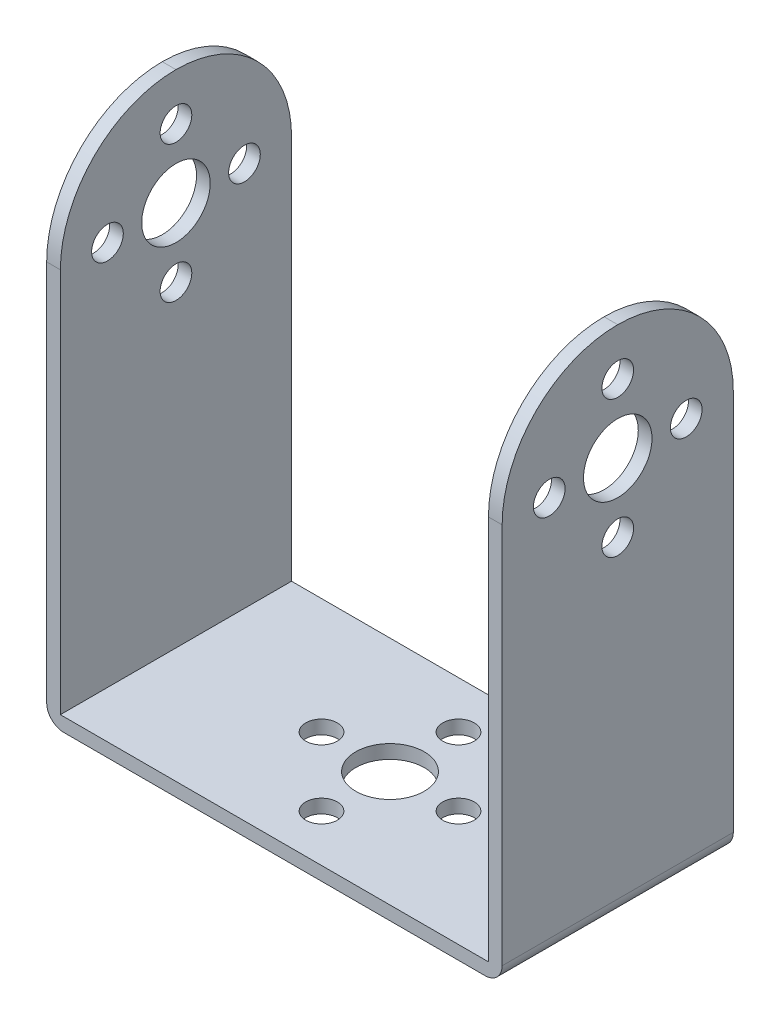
ISO-10303-21;
HEADER;
FILE_DESCRIPTION(('STEP AP214'),'2;1');
FILE_NAME('part.step','',(''),(''),'','','');
FILE_SCHEMA(('AUTOMOTIVE_DESIGN { 1 0 10303 214 1 1 1 1 }'));
ENDSEC;
DATA;
#1=APPLICATION_CONTEXT('core data for automotive mechanical design processes');
#2=APPLICATION_PROTOCOL_DEFINITION('international standard','automotive_design',2000,#1);
#3=PRODUCT_CONTEXT('',#1,'mechanical');
#4=PRODUCT('Part','Part','',(#3));
#5=PRODUCT_RELATED_PRODUCT_CATEGORY('part','',(#4));
#6=PRODUCT_DEFINITION_FORMATION('','',#4);
#7=PRODUCT_DEFINITION_CONTEXT('part definition',#1,'design');
#8=PRODUCT_DEFINITION('design','',#6,#7);
#9=PRODUCT_DEFINITION_SHAPE('','',#8);
#10=(LENGTH_UNIT() NAMED_UNIT(*) SI_UNIT(.MILLI.,.METRE.));
#11=(NAMED_UNIT(*) PLANE_ANGLE_UNIT() SI_UNIT($,.RADIAN.));
#12=(NAMED_UNIT(*) SI_UNIT($,.STERADIAN.) SOLID_ANGLE_UNIT());
#13=UNCERTAINTY_MEASURE_WITH_UNIT(LENGTH_MEASURE(1.E-05),#10,'distance_accuracy_value','');
#14=(GEOMETRIC_REPRESENTATION_CONTEXT(3) GLOBAL_UNCERTAINTY_ASSIGNED_CONTEXT((#13)) GLOBAL_UNIT_ASSIGNED_CONTEXT((#10,
#11,#12)) REPRESENTATION_CONTEXT('',''));
#15=CARTESIAN_POINT('',(0.,0.,0.));
#16=DIRECTION('',(0.,0.,1.));
#17=DIRECTION('',(1.,0.,0.));
#18=AXIS2_PLACEMENT_3D('',#15,#16,#17);
#19=CARTESIAN_POINT('',(0.,60.1,-27.));
#20=DIRECTION('',(-1.,0.,0.));
#21=DIRECTION('',(0.,-1.,0.));
#22=AXIS2_PLACEMENT_3D('',#19,#20,#21);
#23=PLANE('',#22);
#24=CARTESIAN_POINT('',(0.,54.6,-13.5));
#25=DIRECTION('',(1.,0.,0.));
#26=DIRECTION('',(0.,0.,-1.));
#27=AXIS2_PLACEMENT_3D('',#24,#25,#26);
#28=CIRCLE('',#27,1.85);
#29=CARTESIAN_POINT('',(0.,54.6,-15.35));
#30=VERTEX_POINT('',#29);
#31=EDGE_CURVE('E309',#30,#30,#28,.T.);
#32=ORIENTED_EDGE('',*,*,#31,.T.);
#33=EDGE_LOOP('',(#32));
#34=FACE_BOUND('',#33,.T.);
#35=CARTESIAN_POINT('',(0.,38.6,-13.5));
#36=DIRECTION('',(1.,0.,0.));
#37=DIRECTION('',(0.,0.,-1.));
#38=AXIS2_PLACEMENT_3D('',#35,#36,#37);
#39=CIRCLE('',#38,1.85);
#40=CARTESIAN_POINT('',(0.,38.6,-15.35));
#41=VERTEX_POINT('',#40);
#42=EDGE_CURVE('E297',#41,#41,#39,.T.);
#43=ORIENTED_EDGE('',*,*,#42,.T.);
#44=EDGE_LOOP('',(#43));
#45=FACE_BOUND('',#44,.T.);
#46=CARTESIAN_POINT('',(0.,46.6,-5.5));
#47=DIRECTION('',(1.,0.,0.));
#48=DIRECTION('',(0.,0.,-1.));
#49=AXIS2_PLACEMENT_3D('',#46,#47,#48);
#50=CIRCLE('',#49,1.85);
#51=CARTESIAN_POINT('',(0.,46.6,-7.35));
#52=VERTEX_POINT('',#51);
#53=EDGE_CURVE('E285',#52,#52,#50,.T.);
#54=ORIENTED_EDGE('',*,*,#53,.T.);
#55=EDGE_LOOP('',(#54));
#56=FACE_BOUND('',#55,.T.);
#57=CARTESIAN_POINT('',(0.,46.6,-21.5));
#58=DIRECTION('',(1.,0.,0.));
#59=DIRECTION('',(0.,0.,-1.));
#60=AXIS2_PLACEMENT_3D('',#57,#58,#59);
#61=CIRCLE('',#60,1.85);
#62=CARTESIAN_POINT('',(0.,46.6,-23.35));
#63=VERTEX_POINT('',#62);
#64=EDGE_CURVE('E273',#63,#63,#61,.T.);
#65=ORIENTED_EDGE('',*,*,#64,.T.);
#66=EDGE_LOOP('',(#65));
#67=FACE_BOUND('',#66,.T.);
#68=CARTESIAN_POINT('',(0.,46.6,-13.5));
#69=DIRECTION('',(1.,0.,0.));
#70=DIRECTION('',(0.,0.,-1.));
#71=AXIS2_PLACEMENT_3D('',#68,#69,#70);
#72=CIRCLE('',#71,4.);
#73=CARTESIAN_POINT('',(0.,46.6,-17.5));
#74=VERTEX_POINT('',#73);
#75=EDGE_CURVE('E261',#74,#74,#72,.T.);
#76=ORIENTED_EDGE('',*,*,#75,.T.);
#77=EDGE_LOOP('',(#76));
#78=FACE_BOUND('',#77,.T.);
#79=DIRECTION('',(0.,-1.,0.));
#80=VECTOR('',#79,1.);
#81=CARTESIAN_POINT('',(0.,60.1,-27.));
#82=LINE('',#81,#80);
#83=CARTESIAN_POINT('',(0.,46.6,-27.));
#84=VERTEX_POINT('',#83);
#85=CARTESIAN_POINT('',(0.,2.,-27.));
#86=VERTEX_POINT('',#85);
#87=EDGE_CURVE('E167',#84,#86,#82,.T.);
#88=ORIENTED_EDGE('',*,*,#87,.T.);
#89=DIRECTION('',(0.,0.,1.));
#90=VECTOR('',#89,1.);
#91=CARTESIAN_POINT('',(0.,2.,-27.));
#92=LINE('',#91,#90);
#93=CARTESIAN_POINT('',(0.,2.,0.));
#94=VERTEX_POINT('',#93);
#95=EDGE_CURVE('E211',#86,#94,#92,.T.);
#96=ORIENTED_EDGE('',*,*,#95,.T.);
#97=DIRECTION('',(0.,-1.,0.));
#98=VECTOR('',#97,1.);
#99=CARTESIAN_POINT('',(0.,60.1,0.));
#100=LINE('',#99,#98);
#101=CARTESIAN_POINT('',(0.,46.6,0.));
#102=VERTEX_POINT('',#101);
#103=EDGE_CURVE('E154',#102,#94,#100,.T.);
#104=ORIENTED_EDGE('',*,*,#103,.F.);
#105=CARTESIAN_POINT('',(0.,46.6,-13.5));
#106=DIRECTION('',(-1.,0.,0.));
#107=DIRECTION('',(0.,-1.,0.));
#108=AXIS2_PLACEMENT_3D('',#105,#106,#107);
#109=CIRCLE('',#108,13.5);
#110=CARTESIAN_POINT('',(0.,60.1,-13.5));
#111=VERTEX_POINT('',#110);
#112=EDGE_CURVE('E197',#102,#111,#109,.T.);
#113=ORIENTED_EDGE('',*,*,#112,.T.);
#114=CARTESIAN_POINT('',(0.,46.6,-13.5));
#115=DIRECTION('',(-1.,0.,0.));
#116=DIRECTION('',(0.,-1.,0.));
#117=AXIS2_PLACEMENT_3D('',#114,#115,#116);
#118=CIRCLE('',#117,13.5);
#119=EDGE_CURVE('E188',#111,#84,#118,.T.);
#120=ORIENTED_EDGE('',*,*,#119,.T.);
#121=EDGE_LOOP('',(#88,#96,#104,#113,#120));
#122=FACE_BOUND('',#121,.T.);
#123=ADVANCED_FACE('F37',(#34,#45,#56,#67,#78,#122),#23,.T.);
#124=CARTESIAN_POINT('',(1.6,1.59999999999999,-27.));
#125=DIRECTION('',(1.,0.,0.));
#126=DIRECTION('',(0.,0.,-1.));
#127=AXIS2_PLACEMENT_3D('',#124,#125,#126);
#128=PLANE('',#127);
#129=CARTESIAN_POINT('',(1.6,54.6,-13.5));
#130=DIRECTION('',(1.,0.,0.));
#131=DIRECTION('',(0.,0.,-1.));
#132=AXIS2_PLACEMENT_3D('',#129,#130,#131);
#133=CIRCLE('',#132,1.85);
#134=CARTESIAN_POINT('',(1.6,54.6,-15.35));
#135=VERTEX_POINT('',#134);
#136=EDGE_CURVE('E301',#135,#135,#133,.T.);
#137=ORIENTED_EDGE('',*,*,#136,.F.);
#138=EDGE_LOOP('',(#137));
#139=FACE_BOUND('',#138,.T.);
#140=CARTESIAN_POINT('',(1.6,38.6,-13.5));
#141=DIRECTION('',(1.,0.,0.));
#142=DIRECTION('',(0.,0.,-1.));
#143=AXIS2_PLACEMENT_3D('',#140,#141,#142);
#144=CIRCLE('',#143,1.85);
#145=CARTESIAN_POINT('',(1.6,38.6,-15.35));
#146=VERTEX_POINT('',#145);
#147=EDGE_CURVE('E289',#146,#146,#144,.T.);
#148=ORIENTED_EDGE('',*,*,#147,.F.);
#149=EDGE_LOOP('',(#148));
#150=FACE_BOUND('',#149,.T.);
#151=CARTESIAN_POINT('',(1.6,46.6,-5.5));
#152=DIRECTION('',(1.,0.,0.));
#153=DIRECTION('',(0.,0.,-1.));
#154=AXIS2_PLACEMENT_3D('',#151,#152,#153);
#155=CIRCLE('',#154,1.85);
#156=CARTESIAN_POINT('',(1.6,46.6,-7.35));
#157=VERTEX_POINT('',#156);
#158=EDGE_CURVE('E277',#157,#157,#155,.T.);
#159=ORIENTED_EDGE('',*,*,#158,.F.);
#160=EDGE_LOOP('',(#159));
#161=FACE_BOUND('',#160,.T.);
#162=CARTESIAN_POINT('',(1.6,46.6,-21.5));
#163=DIRECTION('',(1.,0.,0.));
#164=DIRECTION('',(0.,0.,-1.));
#165=AXIS2_PLACEMENT_3D('',#162,#163,#164);
#166=CIRCLE('',#165,1.85);
#167=CARTESIAN_POINT('',(1.6,46.6,-23.35));
#168=VERTEX_POINT('',#167);
#169=EDGE_CURVE('E265',#168,#168,#166,.T.);
#170=ORIENTED_EDGE('',*,*,#169,.F.);
#171=EDGE_LOOP('',(#170));
#172=FACE_BOUND('',#171,.T.);
#173=CARTESIAN_POINT('',(1.6,46.6,-13.5));
#174=DIRECTION('',(1.,0.,0.));
#175=DIRECTION('',(0.,0.,-1.));
#176=AXIS2_PLACEMENT_3D('',#173,#174,#175);
#177=CIRCLE('',#176,4.);
#178=CARTESIAN_POINT('',(1.6,46.6,-17.5));
#179=VERTEX_POINT('',#178);
#180=EDGE_CURVE('E157',#179,#179,#177,.T.);
#181=ORIENTED_EDGE('',*,*,#180,.F.);
#182=EDGE_LOOP('',(#181));
#183=FACE_BOUND('',#182,.T.);
#184=CARTESIAN_POINT('',(1.6,46.6,-13.5));
#185=DIRECTION('',(1.,0.,0.));
#186=DIRECTION('',(0.,0.,-1.));
#187=AXIS2_PLACEMENT_3D('',#184,#185,#186);
#188=CIRCLE('',#187,13.5);
#189=CARTESIAN_POINT('',(1.6,46.6,-27.));
#190=VERTEX_POINT('',#189);
#191=CARTESIAN_POINT('',(1.6,60.1,-13.5));
#192=VERTEX_POINT('',#191);
#193=EDGE_CURVE('E192',#190,#192,#188,.T.);
#194=ORIENTED_EDGE('',*,*,#193,.T.);
#195=CARTESIAN_POINT('',(1.6,46.6,-13.5));
#196=DIRECTION('',(1.,0.,0.));
#197=DIRECTION('',(0.,0.,-1.));
#198=AXIS2_PLACEMENT_3D('',#195,#196,#197);
#199=CIRCLE('',#198,13.5);
#200=CARTESIAN_POINT('',(1.6,46.6,0.));
#201=VERTEX_POINT('',#200);
#202=EDGE_CURVE('E199',#192,#201,#199,.T.);
#203=ORIENTED_EDGE('',*,*,#202,.T.);
#204=DIRECTION('',(0.,1.,0.));
#205=VECTOR('',#204,1.);
#206=CARTESIAN_POINT('',(1.6,1.59999999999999,0.));
#207=LINE('',#206,#205);
#208=CARTESIAN_POINT('',(1.6,1.59999999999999,0.));
#209=VERTEX_POINT('',#208);
#210=EDGE_CURVE('E164',#209,#201,#207,.T.);
#211=ORIENTED_EDGE('',*,*,#210,.F.);
#212=DIRECTION('',(0.,0.,1.));
#213=VECTOR('',#212,1.);
#214=CARTESIAN_POINT('',(1.6,1.59999999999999,-27.));
#215=LINE('',#214,#213);
#216=CARTESIAN_POINT('',(1.6,1.59999999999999,-27.));
#217=VERTEX_POINT('',#216);
#218=EDGE_CURVE('E144',#217,#209,#215,.T.);
#219=ORIENTED_EDGE('',*,*,#218,.F.);
#220=DIRECTION('',(0.,1.,0.));
#221=VECTOR('',#220,1.);
#222=CARTESIAN_POINT('',(1.6,1.59999999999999,-27.));
#223=LINE('',#222,#221);
#224=EDGE_CURVE('E145',#217,#190,#223,.T.);
#225=ORIENTED_EDGE('',*,*,#224,.T.);
#226=EDGE_LOOP('',(#194,#203,#211,#219,#225));
#227=FACE_BOUND('',#226,.T.);
#228=ADVANCED_FACE('F234',(#139,#150,#161,#172,#183,#227),#128,.T.);
#229=CARTESIAN_POINT('',(51.6,1.6,-27.));
#230=DIRECTION('',(0.,1.,0.));
#231=DIRECTION('',(-1.,0.,0.));
#232=AXIS2_PLACEMENT_3D('',#229,#230,#231);
#233=PLANE('',#232);
#234=CARTESIAN_POINT('',(26.6,1.59999999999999,-5.5));
#235=DIRECTION('',(0.,1.,0.));
#236=DIRECTION('',(-1.,0.,0.));
#237=AXIS2_PLACEMENT_3D('',#234,#235,#236);
#238=CIRCLE('',#237,1.85);
#239=CARTESIAN_POINT('',(24.75,1.59999999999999,-5.5));
#240=VERTEX_POINT('',#239);
#241=EDGE_CURVE('E339',#240,#240,#238,.T.);
#242=ORIENTED_EDGE('',*,*,#241,.F.);
#243=EDGE_LOOP('',(#242));
#244=FACE_BOUND('',#243,.T.);
#245=CARTESIAN_POINT('',(26.6,1.59999999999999,-21.5));
#246=DIRECTION('',(0.,1.,0.));
#247=DIRECTION('',(-1.,0.,0.));
#248=AXIS2_PLACEMENT_3D('',#245,#246,#247);
#249=CIRCLE('',#248,1.85);
#250=CARTESIAN_POINT('',(24.75,1.59999999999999,-21.5));
#251=VERTEX_POINT('',#250);
#252=EDGE_CURVE('E333',#251,#251,#249,.T.);
#253=ORIENTED_EDGE('',*,*,#252,.F.);
#254=EDGE_LOOP('',(#253));
#255=FACE_BOUND('',#254,.T.);
#256=CARTESIAN_POINT('',(18.6,1.59999999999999,-13.5));
#257=DIRECTION('',(0.,1.,0.));
#258=DIRECTION('',(-1.,0.,0.));
#259=AXIS2_PLACEMENT_3D('',#256,#257,#258);
#260=CIRCLE('',#259,1.85);
#261=CARTESIAN_POINT('',(16.75,1.59999999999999,-13.5));
#262=VERTEX_POINT('',#261);
#263=EDGE_CURVE('E327',#262,#262,#260,.T.);
#264=ORIENTED_EDGE('',*,*,#263,.F.);
#265=EDGE_LOOP('',(#264));
#266=FACE_BOUND('',#265,.T.);
#267=CARTESIAN_POINT('',(34.6,1.6,-13.5));
#268=DIRECTION('',(0.,1.,0.));
#269=DIRECTION('',(-1.,0.,0.));
#270=AXIS2_PLACEMENT_3D('',#267,#268,#269);
#271=CIRCLE('',#270,1.84999999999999);
#272=CARTESIAN_POINT('',(32.75,1.6,-13.5));
#273=VERTEX_POINT('',#272);
#274=EDGE_CURVE('E321',#273,#273,#271,.T.);
#275=ORIENTED_EDGE('',*,*,#274,.F.);
#276=EDGE_LOOP('',(#275));
#277=FACE_BOUND('',#276,.T.);
#278=CARTESIAN_POINT('',(26.6,1.59999999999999,-13.5));
#279=DIRECTION('',(0.,1.,0.));
#280=DIRECTION('',(-1.,0.,0.));
#281=AXIS2_PLACEMENT_3D('',#278,#279,#280);
#282=CIRCLE('',#281,4.);
#283=CARTESIAN_POINT('',(22.6,1.59999999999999,-13.5));
#284=VERTEX_POINT('',#283);
#285=EDGE_CURVE('E313',#284,#284,#282,.T.);
#286=ORIENTED_EDGE('',*,*,#285,.F.);
#287=EDGE_LOOP('',(#286));
#288=FACE_BOUND('',#287,.T.);
#289=DIRECTION('',(-1.,0.,0.));
#290=VECTOR('',#289,1.);
#291=CARTESIAN_POINT('',(51.6,1.6,0.));
#292=LINE('',#291,#290);
#293=CARTESIAN_POINT('',(51.6,1.6,0.));
#294=VERTEX_POINT('',#293);
#295=EDGE_CURVE('E143',#294,#209,#292,.T.);
#296=ORIENTED_EDGE('',*,*,#295,.F.);
#297=DIRECTION('',(0.,0.,1.));
#298=VECTOR('',#297,1.);
#299=CARTESIAN_POINT('',(51.6,1.6,-27.));
#300=LINE('',#299,#298);
#301=CARTESIAN_POINT('',(51.6,1.6,-27.));
#302=VERTEX_POINT('',#301);
#303=EDGE_CURVE('E129',#302,#294,#300,.T.);
#304=ORIENTED_EDGE('',*,*,#303,.F.);
#305=DIRECTION('',(-1.,0.,0.));
#306=VECTOR('',#305,1.);
#307=CARTESIAN_POINT('',(51.6,1.6,-27.));
#308=LINE('',#307,#306);
#309=EDGE_CURVE('E136',#302,#217,#308,.T.);
#310=ORIENTED_EDGE('',*,*,#309,.T.);
#311=ORIENTED_EDGE('',*,*,#218,.T.);
#312=EDGE_LOOP('',(#296,#304,#310,#311));
#313=FACE_BOUND('',#312,.T.);
#314=ADVANCED_FACE('F141',(#244,#255,#266,#277,#288,#313),#233,.T.);
#315=CARTESIAN_POINT('',(51.6,60.1,-27.));
#316=DIRECTION('',(-1.,0.,0.));
#317=DIRECTION('',(0.,-1.,0.));
#318=AXIS2_PLACEMENT_3D('',#315,#316,#317);
#319=PLANE('',#318);
#320=CARTESIAN_POINT('',(51.6,54.6,-13.5));
#321=DIRECTION('',(-1.,0.,0.));
#322=DIRECTION('',(0.,-1.,0.));
#323=AXIS2_PLACEMENT_3D('',#320,#321,#322);
#324=CIRCLE('',#323,1.85);
#325=CARTESIAN_POINT('',(51.6,52.75,-13.5));
#326=VERTEX_POINT('',#325);
#327=EDGE_CURVE('E306',#326,#326,#324,.T.);
#328=ORIENTED_EDGE('',*,*,#327,.F.);
#329=EDGE_LOOP('',(#328));
#330=FACE_BOUND('',#329,.T.);
#331=CARTESIAN_POINT('',(51.6,38.6,-13.5));
#332=DIRECTION('',(-1.,0.,0.));
#333=DIRECTION('',(0.,-1.,0.));
#334=AXIS2_PLACEMENT_3D('',#331,#332,#333);
#335=CIRCLE('',#334,1.85);
#336=CARTESIAN_POINT('',(51.6,36.75,-13.5));
#337=VERTEX_POINT('',#336);
#338=EDGE_CURVE('E294',#337,#337,#335,.T.);
#339=ORIENTED_EDGE('',*,*,#338,.F.);
#340=EDGE_LOOP('',(#339));
#341=FACE_BOUND('',#340,.T.);
#342=CARTESIAN_POINT('',(51.6,46.6,-5.5));
#343=DIRECTION('',(-1.,0.,0.));
#344=DIRECTION('',(0.,-1.,0.));
#345=AXIS2_PLACEMENT_3D('',#342,#343,#344);
#346=CIRCLE('',#345,1.85);
#347=CARTESIAN_POINT('',(51.6,44.75,-5.5));
#348=VERTEX_POINT('',#347);
#349=EDGE_CURVE('E282',#348,#348,#346,.T.);
#350=ORIENTED_EDGE('',*,*,#349,.F.);
#351=EDGE_LOOP('',(#350));
#352=FACE_BOUND('',#351,.T.);
#353=CARTESIAN_POINT('',(51.6,46.6,-21.5));
#354=DIRECTION('',(-1.,0.,0.));
#355=DIRECTION('',(0.,-1.,0.));
#356=AXIS2_PLACEMENT_3D('',#353,#354,#355);
#357=CIRCLE('',#356,1.85);
#358=CARTESIAN_POINT('',(51.6,44.75,-21.5));
#359=VERTEX_POINT('',#358);
#360=EDGE_CURVE('E270',#359,#359,#357,.T.);
#361=ORIENTED_EDGE('',*,*,#360,.F.);
#362=EDGE_LOOP('',(#361));
#363=FACE_BOUND('',#362,.T.);
#364=CARTESIAN_POINT('',(51.6,46.6,-13.5));
#365=DIRECTION('',(-1.,0.,0.));
#366=DIRECTION('',(0.,-1.,0.));
#367=AXIS2_PLACEMENT_3D('',#364,#365,#366);
#368=CIRCLE('',#367,4.);
#369=CARTESIAN_POINT('',(51.6,42.6,-13.5));
#370=VERTEX_POINT('',#369);
#371=EDGE_CURVE('E258',#370,#370,#368,.T.);
#372=ORIENTED_EDGE('',*,*,#371,.F.);
#373=EDGE_LOOP('',(#372));
#374=FACE_BOUND('',#373,.T.);
#375=CARTESIAN_POINT('',(51.6,46.6,-13.5));
#376=DIRECTION('',(-1.,0.,0.));
#377=DIRECTION('',(0.,-1.,0.));
#378=AXIS2_PLACEMENT_3D('',#375,#376,#377);
#379=CIRCLE('',#378,13.5);
#380=CARTESIAN_POINT('',(51.6,46.6,0.));
#381=VERTEX_POINT('',#380);
#382=CARTESIAN_POINT('',(51.6,60.1,-13.5));
#383=VERTEX_POINT('',#382);
#384=EDGE_CURVE('E172',#381,#383,#379,.T.);
#385=ORIENTED_EDGE('',*,*,#384,.T.);
#386=CARTESIAN_POINT('',(51.6,46.6,-13.5));
#387=DIRECTION('',(-1.,0.,0.));
#388=DIRECTION('',(0.,-1.,0.));
#389=AXIS2_PLACEMENT_3D('',#386,#387,#388);
#390=CIRCLE('',#389,13.5);
#391=CARTESIAN_POINT('',(51.6,46.6,-27.));
#392=VERTEX_POINT('',#391);
#393=EDGE_CURVE('E131',#383,#392,#390,.T.);
#394=ORIENTED_EDGE('',*,*,#393,.T.);
#395=DIRECTION('',(0.,-1.,0.));
#396=VECTOR('',#395,1.);
#397=CARTESIAN_POINT('',(51.6,60.1,-27.));
#398=LINE('',#397,#396);
#399=EDGE_CURVE('E124',#392,#302,#398,.T.);
#400=ORIENTED_EDGE('',*,*,#399,.T.);
#401=ORIENTED_EDGE('',*,*,#303,.T.);
#402=DIRECTION('',(0.,-1.,0.));
#403=VECTOR('',#402,1.);
#404=CARTESIAN_POINT('',(51.6,60.1,0.));
#405=LINE('',#404,#403);
#406=EDGE_CURVE('E161',#381,#294,#405,.T.);
#407=ORIENTED_EDGE('',*,*,#406,.F.);
#408=EDGE_LOOP('',(#385,#394,#400,#401,#407));
#409=FACE_BOUND('',#408,.T.);
#410=ADVANCED_FACE('F127',(#330,#341,#352,#363,#374,#409),#319,.T.);
#411=CARTESIAN_POINT('',(53.2,0.,-27.));
#412=DIRECTION('',(1.,0.,0.));
#413=DIRECTION('',(0.,0.,-1.));
#414=AXIS2_PLACEMENT_3D('',#411,#412,#413);
#415=PLANE('',#414);
#416=CARTESIAN_POINT('',(53.2,54.6,-13.5));
#417=DIRECTION('',(1.,0.,0.));
#418=DIRECTION('',(0.,0.,-1.));
#419=AXIS2_PLACEMENT_3D('',#416,#417,#418);
#420=CIRCLE('',#419,1.85);
#421=CARTESIAN_POINT('',(53.2,54.6,-15.35));
#422=VERTEX_POINT('',#421);
#423=EDGE_CURVE('E310',#422,#422,#420,.T.);
#424=ORIENTED_EDGE('',*,*,#423,.F.);
#425=EDGE_LOOP('',(#424));
#426=FACE_BOUND('',#425,.T.);
#427=CARTESIAN_POINT('',(53.2,38.6,-13.5));
#428=DIRECTION('',(1.,0.,0.));
#429=DIRECTION('',(0.,0.,-1.));
#430=AXIS2_PLACEMENT_3D('',#427,#428,#429);
#431=CIRCLE('',#430,1.85);
#432=CARTESIAN_POINT('',(53.2,38.6,-15.35));
#433=VERTEX_POINT('',#432);
#434=EDGE_CURVE('E298',#433,#433,#431,.T.);
#435=ORIENTED_EDGE('',*,*,#434,.F.);
#436=EDGE_LOOP('',(#435));
#437=FACE_BOUND('',#436,.T.);
#438=CARTESIAN_POINT('',(53.2,46.6,-5.5));
#439=DIRECTION('',(1.,0.,0.));
#440=DIRECTION('',(0.,0.,-1.));
#441=AXIS2_PLACEMENT_3D('',#438,#439,#440);
#442=CIRCLE('',#441,1.85);
#443=CARTESIAN_POINT('',(53.2,46.6,-7.35));
#444=VERTEX_POINT('',#443);
#445=EDGE_CURVE('E286',#444,#444,#442,.T.);
#446=ORIENTED_EDGE('',*,*,#445,.F.);
#447=EDGE_LOOP('',(#446));
#448=FACE_BOUND('',#447,.T.);
#449=CARTESIAN_POINT('',(53.2,46.6,-21.5));
#450=DIRECTION('',(1.,0.,0.));
#451=DIRECTION('',(0.,0.,-1.));
#452=AXIS2_PLACEMENT_3D('',#449,#450,#451);
#453=CIRCLE('',#452,1.85);
#454=CARTESIAN_POINT('',(53.2,46.6,-23.35));
#455=VERTEX_POINT('',#454);
#456=EDGE_CURVE('E274',#455,#455,#453,.T.);
#457=ORIENTED_EDGE('',*,*,#456,.F.);
#458=EDGE_LOOP('',(#457));
#459=FACE_BOUND('',#458,.T.);
#460=CARTESIAN_POINT('',(53.2,46.6,-13.5));
#461=DIRECTION('',(1.,0.,0.));
#462=DIRECTION('',(0.,0.,-1.));
#463=AXIS2_PLACEMENT_3D('',#460,#461,#462);
#464=CIRCLE('',#463,4.);
#465=CARTESIAN_POINT('',(53.2,46.6,-17.5));
#466=VERTEX_POINT('',#465);
#467=EDGE_CURVE('E262',#466,#466,#464,.T.);
#468=ORIENTED_EDGE('',*,*,#467,.F.);
#469=EDGE_LOOP('',(#468));
#470=FACE_BOUND('',#469,.T.);
#471=DIRECTION('',(0.,1.,0.));
#472=VECTOR('',#471,1.);
#473=CARTESIAN_POINT('',(53.2,0.,0.));
#474=LINE('',#473,#472);
#475=CARTESIAN_POINT('',(53.2,2.,0.));
#476=VERTEX_POINT('',#475);
#477=CARTESIAN_POINT('',(53.2,46.6,0.));
#478=VERTEX_POINT('',#477);
#479=EDGE_CURVE('E159',#476,#478,#474,.T.);
#480=ORIENTED_EDGE('',*,*,#479,.F.);
#481=DIRECTION('',(0.,0.,1.));
#482=VECTOR('',#481,1.);
#483=CARTESIAN_POINT('',(53.2,2.,-27.));
#484=LINE('',#483,#482);
#485=CARTESIAN_POINT('',(53.2,2.,-27.));
#486=VERTEX_POINT('',#485);
#487=EDGE_CURVE('E206',#476,#486,#484,.F.);
#488=ORIENTED_EDGE('',*,*,#487,.T.);
#489=DIRECTION('',(0.,1.,0.));
#490=VECTOR('',#489,1.);
#491=CARTESIAN_POINT('',(53.2,0.,-27.));
#492=LINE('',#491,#490);
#493=CARTESIAN_POINT('',(53.2,46.6,-27.));
#494=VERTEX_POINT('',#493);
#495=EDGE_CURVE('E137',#486,#494,#492,.T.);
#496=ORIENTED_EDGE('',*,*,#495,.T.);
#497=CARTESIAN_POINT('',(53.2,46.6,-13.5));
#498=DIRECTION('',(1.,0.,0.));
#499=DIRECTION('',(0.,0.,-1.));
#500=AXIS2_PLACEMENT_3D('',#497,#498,#499);
#501=CIRCLE('',#500,13.5);
#502=CARTESIAN_POINT('',(53.2,60.1,-13.5));
#503=VERTEX_POINT('',#502);
#504=EDGE_CURVE('E183',#494,#503,#501,.T.);
#505=ORIENTED_EDGE('',*,*,#504,.T.);
#506=CARTESIAN_POINT('',(53.2,46.6,-13.5));
#507=DIRECTION('',(1.,0.,0.));
#508=DIRECTION('',(0.,0.,-1.));
#509=AXIS2_PLACEMENT_3D('',#506,#507,#508);
#510=CIRCLE('',#509,13.5);
#511=EDGE_CURVE('E177',#503,#478,#510,.T.);
#512=ORIENTED_EDGE('',*,*,#511,.T.);
#513=EDGE_LOOP('',(#480,#488,#496,#505,#512));
#514=FACE_BOUND('',#513,.T.);
#515=ADVANCED_FACE('F350',(#426,#437,#448,#459,#470,#514),#415,.T.);
#516=CARTESIAN_POINT('',(0.,0.,-27.));
#517=DIRECTION('',(0.,-1.,0.));
#518=DIRECTION('',(0.,0.,-1.));
#519=AXIS2_PLACEMENT_3D('',#516,#517,#518);
#520=PLANE('',#519);
#521=CARTESIAN_POINT('',(26.6,0.,-5.5));
#522=DIRECTION('',(0.,-1.,0.));
#523=DIRECTION('',(0.,0.,-1.));
#524=AXIS2_PLACEMENT_3D('',#521,#522,#523);
#525=CIRCLE('',#524,1.85);
#526=CARTESIAN_POINT('',(26.6,0.,-7.35));
#527=VERTEX_POINT('',#526);
#528=EDGE_CURVE('E342',#527,#527,#525,.T.);
#529=ORIENTED_EDGE('',*,*,#528,.F.);
#530=EDGE_LOOP('',(#529));
#531=FACE_BOUND('',#530,.T.);
#532=CARTESIAN_POINT('',(26.6,0.,-21.5));
#533=DIRECTION('',(0.,-1.,0.));
#534=DIRECTION('',(0.,0.,-1.));
#535=AXIS2_PLACEMENT_3D('',#532,#533,#534);
#536=CIRCLE('',#535,1.85);
#537=CARTESIAN_POINT('',(26.6,0.,-23.35));
#538=VERTEX_POINT('',#537);
#539=EDGE_CURVE('E336',#538,#538,#536,.T.);
#540=ORIENTED_EDGE('',*,*,#539,.F.);
#541=EDGE_LOOP('',(#540));
#542=FACE_BOUND('',#541,.T.);
#543=CARTESIAN_POINT('',(18.6,0.,-13.5));
#544=DIRECTION('',(0.,-1.,0.));
#545=DIRECTION('',(0.,0.,-1.));
#546=AXIS2_PLACEMENT_3D('',#543,#544,#545);
#547=CIRCLE('',#546,1.85);
#548=CARTESIAN_POINT('',(18.6,0.,-15.35));
#549=VERTEX_POINT('',#548);
#550=EDGE_CURVE('E330',#549,#549,#547,.T.);
#551=ORIENTED_EDGE('',*,*,#550,.F.);
#552=EDGE_LOOP('',(#551));
#553=FACE_BOUND('',#552,.T.);
#554=CARTESIAN_POINT('',(34.6,0.,-13.5));
#555=DIRECTION('',(0.,-1.,0.));
#556=DIRECTION('',(0.,0.,-1.));
#557=AXIS2_PLACEMENT_3D('',#554,#555,#556);
#558=CIRCLE('',#557,1.84999999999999);
#559=CARTESIAN_POINT('',(34.6,0.,-15.35));
#560=VERTEX_POINT('',#559);
#561=EDGE_CURVE('E324',#560,#560,#558,.T.);
#562=ORIENTED_EDGE('',*,*,#561,.F.);
#563=EDGE_LOOP('',(#562));
#564=FACE_BOUND('',#563,.T.);
#565=CARTESIAN_POINT('',(26.6,0.,-13.5));
#566=DIRECTION('',(0.,-1.,0.));
#567=DIRECTION('',(0.,0.,-1.));
#568=AXIS2_PLACEMENT_3D('',#565,#566,#567);
#569=CIRCLE('',#568,4.);
#570=CARTESIAN_POINT('',(26.6,0.,-17.5));
#571=VERTEX_POINT('',#570);
#572=EDGE_CURVE('E318',#571,#571,#569,.T.);
#573=ORIENTED_EDGE('',*,*,#572,.F.);
#574=EDGE_LOOP('',(#573));
#575=FACE_BOUND('',#574,.T.);
#576=DIRECTION('',(1.,0.,0.));
#577=VECTOR('',#576,1.);
#578=CARTESIAN_POINT('',(0.,0.,0.));
#579=LINE('',#578,#577);
#580=CARTESIAN_POINT('',(2.,0.,0.));
#581=VERTEX_POINT('',#580);
#582=CARTESIAN_POINT('',(51.2,0.,0.));
#583=VERTEX_POINT('',#582);
#584=EDGE_CURVE('E156',#581,#583,#579,.T.);
#585=ORIENTED_EDGE('',*,*,#584,.F.);
#586=DIRECTION('',(0.,0.,1.));
#587=VECTOR('',#586,1.);
#588=CARTESIAN_POINT('',(2.,0.,-27.));
#589=LINE('',#588,#587);
#590=CARTESIAN_POINT('',(2.,0.,-27.));
#591=VERTEX_POINT('',#590);
#592=EDGE_CURVE('E45',#581,#591,#589,.F.);
#593=ORIENTED_EDGE('',*,*,#592,.T.);
#594=DIRECTION('',(1.,0.,0.));
#595=VECTOR('',#594,1.);
#596=CARTESIAN_POINT('',(0.,0.,-27.));
#597=LINE('',#596,#595);
#598=CARTESIAN_POINT('',(51.2,0.,-27.));
#599=VERTEX_POINT('',#598);
#600=EDGE_CURVE('E247',#591,#599,#597,.T.);
#601=ORIENTED_EDGE('',*,*,#600,.T.);
#602=DIRECTION('',(0.,0.,1.));
#603=VECTOR('',#602,1.);
#604=CARTESIAN_POINT('',(51.2,0.,-27.));
#605=LINE('',#604,#603);
#606=EDGE_CURVE('E201',#599,#583,#605,.T.);
#607=ORIENTED_EDGE('',*,*,#606,.T.);
#608=EDGE_LOOP('',(#585,#593,#601,#607));
#609=FACE_BOUND('',#608,.T.);
#610=ADVANCED_FACE('F252',(#531,#542,#553,#564,#575,#609),#520,.T.);
#611=CARTESIAN_POINT('',(0.,60.1,-27.));
#612=DIRECTION('',(0.,0.,-1.));
#613=DIRECTION('',(-1.,0.,0.));
#614=AXIS2_PLACEMENT_3D('',#611,#612,#613);
#615=PLANE('',#614);
#616=ORIENTED_EDGE('',*,*,#600,.F.);
#617=CARTESIAN_POINT('',(2.,2.,-27.));
#618=DIRECTION('',(0.,0.,-1.));
#619=DIRECTION('',(-1.,0.,0.));
#620=AXIS2_PLACEMENT_3D('',#617,#618,#619);
#621=CIRCLE('',#620,2.);
#622=EDGE_CURVE('E11',#591,#86,#621,.T.);
#623=ORIENTED_EDGE('',*,*,#622,.T.);
#624=ORIENTED_EDGE('',*,*,#87,.F.);
#625=DIRECTION('',(-1.,0.,0.));
#626=VECTOR('',#625,1.);
#627=CARTESIAN_POINT('',(0.,46.6,-27.));
#628=LINE('',#627,#626);
#629=EDGE_CURVE('E190',#84,#190,#628,.F.);
#630=ORIENTED_EDGE('',*,*,#629,.T.);
#631=ORIENTED_EDGE('',*,*,#224,.F.);
#632=ORIENTED_EDGE('',*,*,#309,.F.);
#633=ORIENTED_EDGE('',*,*,#399,.F.);
#634=DIRECTION('',(-1.,0.,0.));
#635=VECTOR('',#634,1.);
#636=CARTESIAN_POINT('',(0.,46.6,-27.));
#637=LINE('',#636,#635);
#638=EDGE_CURVE('E181',#392,#494,#637,.F.);
#639=ORIENTED_EDGE('',*,*,#638,.T.);
#640=ORIENTED_EDGE('',*,*,#495,.F.);
#641=CARTESIAN_POINT('',(51.2,2.,-27.));
#642=DIRECTION('',(0.,0.,-1.));
#643=DIRECTION('',(-1.,0.,0.));
#644=AXIS2_PLACEMENT_3D('',#641,#642,#643);
#645=CIRCLE('',#644,2.);
#646=EDGE_CURVE('E208',#486,#599,#645,.T.);
#647=ORIENTED_EDGE('',*,*,#646,.T.);
#648=EDGE_LOOP('',(#616,#623,#624,#630,#631,#632,#633,#639,#640,#647));
#649=FACE_BOUND('',#648,.T.);
#650=ADVANCED_FACE('F148',(#649),#615,.T.);
#651=CARTESIAN_POINT('',(0.,60.1,0.));
#652=DIRECTION('',(0.,0.,-1.));
#653=DIRECTION('',(-1.,0.,0.));
#654=AXIS2_PLACEMENT_3D('',#651,#652,#653);
#655=PLANE('',#654);
#656=ORIENTED_EDGE('',*,*,#103,.T.);
#657=CARTESIAN_POINT('',(2.,2.,0.));
#658=DIRECTION('',(0.,0.,-1.));
#659=DIRECTION('',(-1.,0.,0.));
#660=AXIS2_PLACEMENT_3D('',#657,#658,#659);
#661=CIRCLE('',#660,2.);
#662=EDGE_CURVE('E59',#94,#581,#661,.F.);
#663=ORIENTED_EDGE('',*,*,#662,.T.);
#664=ORIENTED_EDGE('',*,*,#584,.T.);
#665=CARTESIAN_POINT('',(51.2,2.,0.));
#666=DIRECTION('',(0.,0.,-1.));
#667=DIRECTION('',(-1.,0.,0.));
#668=AXIS2_PLACEMENT_3D('',#665,#666,#667);
#669=CIRCLE('',#668,2.);
#670=EDGE_CURVE('E204',#583,#476,#669,.F.);
#671=ORIENTED_EDGE('',*,*,#670,.T.);
#672=ORIENTED_EDGE('',*,*,#479,.T.);
#673=DIRECTION('',(-1.,0.,0.));
#674=VECTOR('',#673,1.);
#675=CARTESIAN_POINT('',(51.6,46.6,0.));
#676=LINE('',#675,#674);
#677=EDGE_CURVE('E168',#478,#381,#676,.T.);
#678=ORIENTED_EDGE('',*,*,#677,.T.);
#679=ORIENTED_EDGE('',*,*,#406,.T.);
#680=ORIENTED_EDGE('',*,*,#295,.T.);
#681=ORIENTED_EDGE('',*,*,#210,.T.);
#682=DIRECTION('',(-1.,0.,0.));
#683=VECTOR('',#682,1.);
#684=CARTESIAN_POINT('',(0.,46.6,0.));
#685=LINE('',#684,#683);
#686=EDGE_CURVE('E194',#201,#102,#685,.T.);
#687=ORIENTED_EDGE('',*,*,#686,.T.);
#688=EDGE_LOOP('',(#656,#663,#664,#671,#672,#678,#679,#680,#681,#687));
#689=FACE_BOUND('',#688,.T.);
#690=ADVANCED_FACE('F221',(#689),#655,.F.);
#691=CARTESIAN_POINT('',(0.,46.6,-13.5));
#692=DIRECTION('',(1.,0.,0.));
#693=DIRECTION('',(0.,0.,-1.));
#694=AXIS2_PLACEMENT_3D('',#691,#692,#693);
#695=CYLINDRICAL_SURFACE('',#694,13.5);
#696=ORIENTED_EDGE('',*,*,#511,.F.);
#697=DIRECTION('',(-1.,0.,0.));
#698=VECTOR('',#697,1.);
#699=CARTESIAN_POINT('',(53.2,60.1,-13.5));
#700=LINE('',#699,#698);
#701=EDGE_CURVE('E174',#383,#503,#700,.F.);
#702=ORIENTED_EDGE('',*,*,#701,.F.);
#703=ORIENTED_EDGE('',*,*,#384,.F.);
#704=ORIENTED_EDGE('',*,*,#677,.F.);
#705=EDGE_LOOP('',(#696,#702,#703,#704));
#706=FACE_BOUND('',#705,.T.);
#707=ADVANCED_FACE('F239',(#706),#695,.T.);
#708=CARTESIAN_POINT('',(53.2,46.6,-13.5));
#709=DIRECTION('',(-1.,0.,0.));
#710=DIRECTION('',(0.,0.,1.));
#711=AXIS2_PLACEMENT_3D('',#708,#709,#710);
#712=CYLINDRICAL_SURFACE('',#711,13.5);
#713=ORIENTED_EDGE('',*,*,#504,.F.);
#714=ORIENTED_EDGE('',*,*,#638,.F.);
#715=ORIENTED_EDGE('',*,*,#393,.F.);
#716=ORIENTED_EDGE('',*,*,#701,.T.);
#717=EDGE_LOOP('',(#713,#714,#715,#716));
#718=FACE_BOUND('',#717,.T.);
#719=ADVANCED_FACE('F242',(#718),#712,.T.);
#720=CARTESIAN_POINT('',(1.6,46.6,-13.5));
#721=DIRECTION('',(-1.,0.,0.));
#722=DIRECTION('',(0.,0.,1.));
#723=AXIS2_PLACEMENT_3D('',#720,#721,#722);
#724=CYLINDRICAL_SURFACE('',#723,13.5);
#725=ORIENTED_EDGE('',*,*,#193,.F.);
#726=ORIENTED_EDGE('',*,*,#629,.F.);
#727=ORIENTED_EDGE('',*,*,#119,.F.);
#728=DIRECTION('',(-1.,0.,0.));
#729=VECTOR('',#728,1.);
#730=CARTESIAN_POINT('',(1.6,60.1,-13.5));
#731=LINE('',#730,#729);
#732=EDGE_CURVE('E185',#192,#111,#731,.T.);
#733=ORIENTED_EDGE('',*,*,#732,.F.);
#734=EDGE_LOOP('',(#725,#726,#727,#733));
#735=FACE_BOUND('',#734,.T.);
#736=ADVANCED_FACE('F232',(#735),#724,.T.);
#737=CARTESIAN_POINT('',(0.,46.6,-13.5));
#738=DIRECTION('',(1.,0.,0.));
#739=DIRECTION('',(0.,0.,-1.));
#740=AXIS2_PLACEMENT_3D('',#737,#738,#739);
#741=CYLINDRICAL_SURFACE('',#740,13.5);
#742=ORIENTED_EDGE('',*,*,#202,.F.);
#743=ORIENTED_EDGE('',*,*,#732,.T.);
#744=ORIENTED_EDGE('',*,*,#112,.F.);
#745=ORIENTED_EDGE('',*,*,#686,.F.);
#746=EDGE_LOOP('',(#742,#743,#744,#745));
#747=FACE_BOUND('',#746,.T.);
#748=ADVANCED_FACE('F226',(#747),#741,.T.);
#749=CARTESIAN_POINT('',(0.,46.6,-13.5));
#750=DIRECTION('',(1.,0.,0.));
#751=DIRECTION('',(0.,0.,-1.));
#752=AXIS2_PLACEMENT_3D('',#749,#750,#751);
#753=CYLINDRICAL_SURFACE('',#752,4.);
#754=ORIENTED_EDGE('',*,*,#371,.T.);
#755=EDGE_LOOP('',(#754));
#756=FACE_BOUND('',#755,.T.);
#757=ORIENTED_EDGE('',*,*,#467,.T.);
#758=EDGE_LOOP('',(#757));
#759=FACE_BOUND('',#758,.T.);
#760=ADVANCED_FACE('F394',(#756,#759),#753,.F.);
#761=ORIENTED_EDGE('',*,*,#180,.T.);
#762=EDGE_LOOP('',(#761));
#763=FACE_BOUND('',#762,.T.);
#764=ORIENTED_EDGE('',*,*,#75,.F.);
#765=EDGE_LOOP('',(#764));
#766=FACE_BOUND('',#765,.T.);
#767=ADVANCED_FACE('F448',(#763,#766),#753,.F.);
#768=CARTESIAN_POINT('',(0.,46.6,-21.5));
#769=DIRECTION('',(1.,0.,0.));
#770=DIRECTION('',(0.,0.,-1.));
#771=AXIS2_PLACEMENT_3D('',#768,#769,#770);
#772=CYLINDRICAL_SURFACE('',#771,1.85);
#773=ORIENTED_EDGE('',*,*,#360,.T.);
#774=EDGE_LOOP('',(#773));
#775=FACE_BOUND('',#774,.T.);
#776=ORIENTED_EDGE('',*,*,#456,.T.);
#777=EDGE_LOOP('',(#776));
#778=FACE_BOUND('',#777,.T.);
#779=ADVANCED_FACE('F454',(#775,#778),#772,.F.);
#780=ORIENTED_EDGE('',*,*,#169,.T.);
#781=EDGE_LOOP('',(#780));
#782=FACE_BOUND('',#781,.T.);
#783=ORIENTED_EDGE('',*,*,#64,.F.);
#784=EDGE_LOOP('',(#783));
#785=FACE_BOUND('',#784,.T.);
#786=ADVANCED_FACE('F516',(#782,#785),#772,.F.);
#787=CARTESIAN_POINT('',(0.,46.6,-5.5));
#788=DIRECTION('',(1.,0.,0.));
#789=DIRECTION('',(0.,0.,-1.));
#790=AXIS2_PLACEMENT_3D('',#787,#788,#789);
#791=CYLINDRICAL_SURFACE('',#790,1.85);
#792=ORIENTED_EDGE('',*,*,#349,.T.);
#793=EDGE_LOOP('',(#792));
#794=FACE_BOUND('',#793,.T.);
#795=ORIENTED_EDGE('',*,*,#445,.T.);
#796=EDGE_LOOP('',(#795));
#797=FACE_BOUND('',#796,.T.);
#798=ADVANCED_FACE('F525',(#794,#797),#791,.F.);
#799=ORIENTED_EDGE('',*,*,#158,.T.);
#800=EDGE_LOOP('',(#799));
#801=FACE_BOUND('',#800,.T.);
#802=ORIENTED_EDGE('',*,*,#53,.F.);
#803=EDGE_LOOP('',(#802));
#804=FACE_BOUND('',#803,.T.);
#805=ADVANCED_FACE('F534',(#801,#804),#791,.F.);
#806=CARTESIAN_POINT('',(0.,38.6,-13.5));
#807=DIRECTION('',(1.,0.,0.));
#808=DIRECTION('',(0.,0.,-1.));
#809=AXIS2_PLACEMENT_3D('',#806,#807,#808);
#810=CYLINDRICAL_SURFACE('',#809,1.85);
#811=ORIENTED_EDGE('',*,*,#338,.T.);
#812=EDGE_LOOP('',(#811));
#813=FACE_BOUND('',#812,.T.);
#814=ORIENTED_EDGE('',*,*,#434,.T.);
#815=EDGE_LOOP('',(#814));
#816=FACE_BOUND('',#815,.T.);
#817=ADVANCED_FACE('F543',(#813,#816),#810,.F.);
#818=ORIENTED_EDGE('',*,*,#147,.T.);
#819=EDGE_LOOP('',(#818));
#820=FACE_BOUND('',#819,.T.);
#821=ORIENTED_EDGE('',*,*,#42,.F.);
#822=EDGE_LOOP('',(#821));
#823=FACE_BOUND('',#822,.T.);
#824=ADVANCED_FACE('F552',(#820,#823),#810,.F.);
#825=CARTESIAN_POINT('',(0.,54.6,-13.5));
#826=DIRECTION('',(1.,0.,0.));
#827=DIRECTION('',(0.,0.,-1.));
#828=AXIS2_PLACEMENT_3D('',#825,#826,#827);
#829=CYLINDRICAL_SURFACE('',#828,1.85);
#830=ORIENTED_EDGE('',*,*,#327,.T.);
#831=EDGE_LOOP('',(#830));
#832=FACE_BOUND('',#831,.T.);
#833=ORIENTED_EDGE('',*,*,#423,.T.);
#834=EDGE_LOOP('',(#833));
#835=FACE_BOUND('',#834,.T.);
#836=ADVANCED_FACE('F373',(#832,#835),#829,.F.);
#837=ORIENTED_EDGE('',*,*,#136,.T.);
#838=EDGE_LOOP('',(#837));
#839=FACE_BOUND('',#838,.T.);
#840=ORIENTED_EDGE('',*,*,#31,.F.);
#841=EDGE_LOOP('',(#840));
#842=FACE_BOUND('',#841,.T.);
#843=ADVANCED_FACE('F363',(#839,#842),#829,.F.);
#844=CARTESIAN_POINT('',(26.6,27.,-13.5));
#845=DIRECTION('',(0.,-1.,0.));
#846=DIRECTION('',(0.,0.,-1.));
#847=AXIS2_PLACEMENT_3D('',#844,#845,#846);
#848=CYLINDRICAL_SURFACE('',#847,4.);
#849=ORIENTED_EDGE('',*,*,#285,.T.);
#850=EDGE_LOOP('',(#849));
#851=FACE_BOUND('',#850,.T.);
#852=ORIENTED_EDGE('',*,*,#572,.T.);
#853=EDGE_LOOP('',(#852));
#854=FACE_BOUND('',#853,.T.);
#855=ADVANCED_FACE('F360',(#851,#854),#848,.F.);
#856=CARTESIAN_POINT('',(34.6,27.,-13.5));
#857=DIRECTION('',(0.,-1.,0.));
#858=DIRECTION('',(0.,0.,-1.));
#859=AXIS2_PLACEMENT_3D('',#856,#857,#858);
#860=CYLINDRICAL_SURFACE('',#859,1.84999999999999);
#861=ORIENTED_EDGE('',*,*,#274,.T.);
#862=EDGE_LOOP('',(#861));
#863=FACE_BOUND('',#862,.T.);
#864=ORIENTED_EDGE('',*,*,#561,.T.);
#865=EDGE_LOOP('',(#864));
#866=FACE_BOUND('',#865,.T.);
#867=ADVANCED_FACE('F362',(#863,#866),#860,.F.);
#868=CARTESIAN_POINT('',(18.6,27.,-13.5));
#869=DIRECTION('',(0.,-1.,0.));
#870=DIRECTION('',(0.,0.,-1.));
#871=AXIS2_PLACEMENT_3D('',#868,#869,#870);
#872=CYLINDRICAL_SURFACE('',#871,1.85);
#873=ORIENTED_EDGE('',*,*,#263,.T.);
#874=EDGE_LOOP('',(#873));
#875=FACE_BOUND('',#874,.T.);
#876=ORIENTED_EDGE('',*,*,#550,.T.);
#877=EDGE_LOOP('',(#876));
#878=FACE_BOUND('',#877,.T.);
#879=ADVANCED_FACE('F370',(#875,#878),#872,.F.);
#880=CARTESIAN_POINT('',(26.6,27.,-21.5));
#881=DIRECTION('',(0.,-1.,0.));
#882=DIRECTION('',(0.,0.,-1.));
#883=AXIS2_PLACEMENT_3D('',#880,#881,#882);
#884=CYLINDRICAL_SURFACE('',#883,1.85);
#885=ORIENTED_EDGE('',*,*,#252,.T.);
#886=EDGE_LOOP('',(#885));
#887=FACE_BOUND('',#886,.T.);
#888=ORIENTED_EDGE('',*,*,#539,.T.);
#889=EDGE_LOOP('',(#888));
#890=FACE_BOUND('',#889,.T.);
#891=ADVANCED_FACE('F400',(#887,#890),#884,.F.);
#892=CARTESIAN_POINT('',(26.6,27.,-5.5));
#893=DIRECTION('',(0.,-1.,0.));
#894=DIRECTION('',(0.,0.,-1.));
#895=AXIS2_PLACEMENT_3D('',#892,#893,#894);
#896=CYLINDRICAL_SURFACE('',#895,1.85);
#897=ORIENTED_EDGE('',*,*,#241,.T.);
#898=EDGE_LOOP('',(#897));
#899=FACE_BOUND('',#898,.T.);
#900=ORIENTED_EDGE('',*,*,#528,.T.);
#901=EDGE_LOOP('',(#900));
#902=FACE_BOUND('',#901,.T.);
#903=ADVANCED_FACE('F346',(#899,#902),#896,.F.);
#904=CARTESIAN_POINT('',(51.2,2.,-27.));
#905=DIRECTION('',(0.,0.,1.));
#906=DIRECTION('',(1.,0.,0.));
#907=AXIS2_PLACEMENT_3D('',#904,#905,#906);
#908=CYLINDRICAL_SURFACE('',#907,2.);
#909=ORIENTED_EDGE('',*,*,#646,.F.);
#910=ORIENTED_EDGE('',*,*,#487,.F.);
#911=ORIENTED_EDGE('',*,*,#670,.F.);
#912=ORIENTED_EDGE('',*,*,#606,.F.);
#913=EDGE_LOOP('',(#909,#910,#911,#912));
#914=FACE_BOUND('',#913,.T.);
#915=ADVANCED_FACE('F250',(#914),#908,.T.);
#916=CARTESIAN_POINT('',(2.,2.,-27.));
#917=DIRECTION('',(0.,0.,1.));
#918=DIRECTION('',(1.,0.,0.));
#919=AXIS2_PLACEMENT_3D('',#916,#917,#918);
#920=CYLINDRICAL_SURFACE('',#919,2.);
#921=ORIENTED_EDGE('',*,*,#622,.F.);
#922=ORIENTED_EDGE('',*,*,#592,.F.);
#923=ORIENTED_EDGE('',*,*,#662,.F.);
#924=ORIENTED_EDGE('',*,*,#95,.F.);
#925=EDGE_LOOP('',(#921,#922,#923,#924));
#926=FACE_BOUND('',#925,.T.);
#927=ADVANCED_FACE('F39',(#926),#920,.T.);
#928=CLOSED_SHELL('',(#123,#228,#314,#410,#515,#610,#650,#690,#707,#719,#736,#748,#760,#767,
#779,#786,#798,#805,#817,#824,#836,#843,#855,#867,#879,#891,#903,#915,#927));
#929=MANIFOLD_SOLID_BREP('B2',#928);
#930=ADVANCED_BREP_SHAPE_REPRESENTATION('',(#18,#929),#14);
#931=SHAPE_DEFINITION_REPRESENTATION(#9,#930);
ENDSEC;
END-ISO-10303-21;
